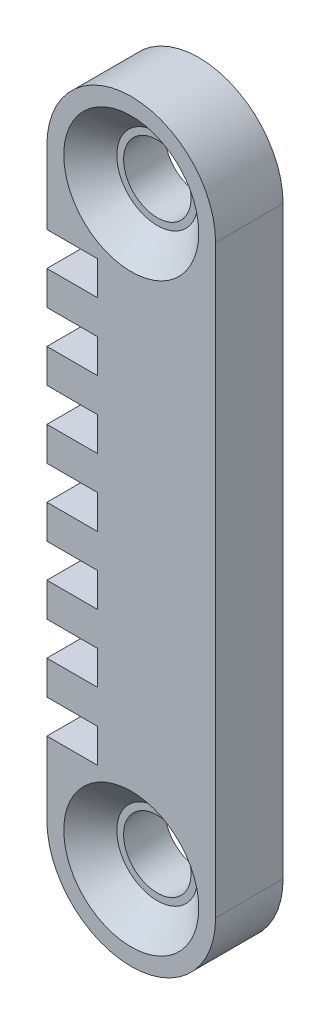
ISO-10303-21;
HEADER;
FILE_DESCRIPTION(('STEP AP214'),'2;1');
FILE_NAME('part.step','',(''),(''),'','','');
FILE_SCHEMA(('AUTOMOTIVE_DESIGN { 1 0 10303 214 1 1 1 1 }'));
ENDSEC;
DATA;
#1=APPLICATION_CONTEXT('core data for automotive mechanical design processes');
#2=APPLICATION_PROTOCOL_DEFINITION('international standard','automotive_design',2000,#1);
#3=PRODUCT_CONTEXT('',#1,'mechanical');
#4=PRODUCT('Part','Part','',(#3));
#5=PRODUCT_RELATED_PRODUCT_CATEGORY('part','',(#4));
#6=PRODUCT_DEFINITION_FORMATION('','',#4);
#7=PRODUCT_DEFINITION_CONTEXT('part definition',#1,'design');
#8=PRODUCT_DEFINITION('design','',#6,#7);
#9=PRODUCT_DEFINITION_SHAPE('','',#8);
#10=(LENGTH_UNIT() NAMED_UNIT(*) SI_UNIT(.MILLI.,.METRE.));
#11=(NAMED_UNIT(*) PLANE_ANGLE_UNIT() SI_UNIT($,.RADIAN.));
#12=(NAMED_UNIT(*) SI_UNIT($,.STERADIAN.) SOLID_ANGLE_UNIT());
#13=UNCERTAINTY_MEASURE_WITH_UNIT(LENGTH_MEASURE(1.E-05),#10,'distance_accuracy_value','');
#14=(GEOMETRIC_REPRESENTATION_CONTEXT(3) GLOBAL_UNCERTAINTY_ASSIGNED_CONTEXT((#13)) GLOBAL_UNIT_ASSIGNED_CONTEXT((#10,
#11,#12)) REPRESENTATION_CONTEXT('',''));
#15=CARTESIAN_POINT('',(0.,0.,0.));
#16=DIRECTION('',(0.,0.,1.));
#17=DIRECTION('',(1.,0.,0.));
#18=AXIS2_PLACEMENT_3D('',#15,#16,#17);
#19=CARTESIAN_POINT('',(-0.999999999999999,0.,2.));
#20=DIRECTION('',(1.,0.,0.));
#21=DIRECTION('',(0.,0.,-1.));
#22=AXIS2_PLACEMENT_3D('',#19,#20,#21);
#23=PLANE('',#22);
#24=DIRECTION('',(0.,-1.,0.));
#25=VECTOR('',#24,1.);
#26=CARTESIAN_POINT('',(-0.999999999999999,0.,0.));
#27=LINE('',#26,#25);
#28=CARTESIAN_POINT('',(-0.999999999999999,0.5,0.));
#29=VERTEX_POINT('',#28);
#30=CARTESIAN_POINT('',(-0.999999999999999,-0.5,0.));
#31=VERTEX_POINT('',#30);
#32=EDGE_CURVE('E297',#29,#31,#27,.T.);
#33=ORIENTED_EDGE('',*,*,#32,.T.);
#34=DIRECTION('',(0.,0.,-1.));
#35=VECTOR('',#34,1.);
#36=CARTESIAN_POINT('',(-0.999999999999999,-0.5,2.));
#37=LINE('',#36,#35);
#38=CARTESIAN_POINT('',(-0.999999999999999,-0.5,2.));
#39=VERTEX_POINT('',#38);
#40=EDGE_CURVE('E11',#39,#31,#37,.T.);
#41=ORIENTED_EDGE('',*,*,#40,.F.);
#42=DIRECTION('',(0.,-1.,0.));
#43=VECTOR('',#42,1.);
#44=CARTESIAN_POINT('',(-0.999999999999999,0.,2.));
#45=LINE('',#44,#43);
#46=CARTESIAN_POINT('',(-0.999999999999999,0.5,2.));
#47=VERTEX_POINT('',#46);
#48=EDGE_CURVE('E400',#47,#39,#45,.T.);
#49=ORIENTED_EDGE('',*,*,#48,.F.);
#50=DIRECTION('',(0.,0.,-1.));
#51=VECTOR('',#50,1.);
#52=CARTESIAN_POINT('',(-0.999999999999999,0.5,2.));
#53=LINE('',#52,#51);
#54=EDGE_CURVE('E289',#47,#29,#53,.T.);
#55=ORIENTED_EDGE('',*,*,#54,.T.);
#56=EDGE_LOOP('',(#33,#41,#49,#55));
#57=FACE_BOUND('',#56,.T.);
#58=ADVANCED_FACE('F45',(#57),#23,.F.);
#59=CARTESIAN_POINT('',(0.,-0.500000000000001,2.));
#60=DIRECTION('',(0.,-1.,0.));
#61=DIRECTION('',(1.,0.,0.));
#62=AXIS2_PLACEMENT_3D('',#59,#60,#61);
#63=PLANE('',#62);
#64=DIRECTION('',(-1.,0.,0.));
#65=VECTOR('',#64,1.);
#66=CARTESIAN_POINT('',(0.,-0.500000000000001,0.));
#67=LINE('',#66,#65);
#68=CARTESIAN_POINT('',(-2.5,-0.499999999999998,0.));
#69=VERTEX_POINT('',#68);
#70=EDGE_CURVE('E302',#31,#69,#67,.T.);
#71=ORIENTED_EDGE('',*,*,#70,.T.);
#72=DIRECTION('',(0.,0.,-1.));
#73=VECTOR('',#72,1.);
#74=CARTESIAN_POINT('',(-2.5,-0.499999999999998,2.));
#75=LINE('',#74,#73);
#76=CARTESIAN_POINT('',(-2.5,-0.499999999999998,2.));
#77=VERTEX_POINT('',#76);
#78=EDGE_CURVE('E56',#77,#69,#75,.T.);
#79=ORIENTED_EDGE('',*,*,#78,.F.);
#80=DIRECTION('',(-1.,0.,0.));
#81=VECTOR('',#80,1.);
#82=CARTESIAN_POINT('',(0.,-0.500000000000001,2.));
#83=LINE('',#82,#81);
#84=EDGE_CURVE('E180',#39,#77,#83,.T.);
#85=ORIENTED_EDGE('',*,*,#84,.F.);
#86=ORIENTED_EDGE('',*,*,#40,.T.);
#87=EDGE_LOOP('',(#71,#79,#85,#86));
#88=FACE_BOUND('',#87,.T.);
#89=ADVANCED_FACE('F641',(#88),#63,.F.);
#90=CARTESIAN_POINT('',(-2.5,0.,2.));
#91=DIRECTION('',(1.,0.,0.));
#92=DIRECTION('',(0.,0.,-1.));
#93=AXIS2_PLACEMENT_3D('',#90,#91,#92);
#94=PLANE('',#93);
#95=DIRECTION('',(0.,-1.,0.));
#96=VECTOR('',#95,1.);
#97=CARTESIAN_POINT('',(-2.5,0.,0.));
#98=LINE('',#97,#96);
#99=CARTESIAN_POINT('',(-2.5,-1.5,0.));
#100=VERTEX_POINT('',#99);
#101=EDGE_CURVE('E305',#69,#100,#98,.T.);
#102=ORIENTED_EDGE('',*,*,#101,.T.);
#103=DIRECTION('',(0.,0.,-1.));
#104=VECTOR('',#103,1.);
#105=CARTESIAN_POINT('',(-2.5,-1.5,2.));
#106=LINE('',#105,#104);
#107=CARTESIAN_POINT('',(-2.5,-1.5,2.));
#108=VERTEX_POINT('',#107);
#109=EDGE_CURVE('E503',#108,#100,#106,.T.);
#110=ORIENTED_EDGE('',*,*,#109,.F.);
#111=DIRECTION('',(0.,-1.,0.));
#112=VECTOR('',#111,1.);
#113=CARTESIAN_POINT('',(-2.5,0.,2.));
#114=LINE('',#113,#112);
#115=EDGE_CURVE('E529',#77,#108,#114,.T.);
#116=ORIENTED_EDGE('',*,*,#115,.F.);
#117=ORIENTED_EDGE('',*,*,#78,.T.);
#118=EDGE_LOOP('',(#102,#110,#116,#117));
#119=FACE_BOUND('',#118,.T.);
#120=ADVANCED_FACE('F645',(#119),#94,.F.);
#121=CARTESIAN_POINT('',(0.,-1.5,2.));
#122=DIRECTION('',(0.,1.,0.));
#123=DIRECTION('',(-1.,0.,0.));
#124=AXIS2_PLACEMENT_3D('',#121,#122,#123);
#125=PLANE('',#124);
#126=DIRECTION('',(1.,0.,0.));
#127=VECTOR('',#126,1.);
#128=CARTESIAN_POINT('',(0.,-1.5,0.));
#129=LINE('',#128,#127);
#130=CARTESIAN_POINT('',(-0.999999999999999,-1.5,0.));
#131=VERTEX_POINT('',#130);
#132=EDGE_CURVE('E308',#100,#131,#129,.T.);
#133=ORIENTED_EDGE('',*,*,#132,.T.);
#134=DIRECTION('',(0.,0.,-1.));
#135=VECTOR('',#134,1.);
#136=CARTESIAN_POINT('',(-0.999999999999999,-1.5,2.));
#137=LINE('',#136,#135);
#138=CARTESIAN_POINT('',(-0.999999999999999,-1.5,2.));
#139=VERTEX_POINT('',#138);
#140=EDGE_CURVE('E499',#139,#131,#137,.T.);
#141=ORIENTED_EDGE('',*,*,#140,.F.);
#142=DIRECTION('',(1.,0.,0.));
#143=VECTOR('',#142,1.);
#144=CARTESIAN_POINT('',(0.,-1.5,2.));
#145=LINE('',#144,#143);
#146=EDGE_CURVE('E532',#108,#139,#145,.T.);
#147=ORIENTED_EDGE('',*,*,#146,.F.);
#148=ORIENTED_EDGE('',*,*,#109,.T.);
#149=EDGE_LOOP('',(#133,#141,#147,#148));
#150=FACE_BOUND('',#149,.T.);
#151=ADVANCED_FACE('F650',(#150),#125,.F.);
#152=CARTESIAN_POINT('',(-0.999999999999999,0.,2.));
#153=DIRECTION('',(1.,0.,0.));
#154=DIRECTION('',(0.,0.,-1.));
#155=AXIS2_PLACEMENT_3D('',#152,#153,#154);
#156=PLANE('',#155);
#157=DIRECTION('',(0.,-1.,0.));
#158=VECTOR('',#157,1.);
#159=CARTESIAN_POINT('',(-0.999999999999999,0.,0.));
#160=LINE('',#159,#158);
#161=CARTESIAN_POINT('',(-0.999999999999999,-2.5,0.));
#162=VERTEX_POINT('',#161);
#163=EDGE_CURVE('E311',#131,#162,#160,.T.);
#164=ORIENTED_EDGE('',*,*,#163,.T.);
#165=DIRECTION('',(0.,0.,-1.));
#166=VECTOR('',#165,1.);
#167=CARTESIAN_POINT('',(-0.999999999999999,-2.5,2.));
#168=LINE('',#167,#166);
#169=CARTESIAN_POINT('',(-0.999999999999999,-2.5,2.));
#170=VERTEX_POINT('',#169);
#171=EDGE_CURVE('E495',#170,#162,#168,.T.);
#172=ORIENTED_EDGE('',*,*,#171,.F.);
#173=DIRECTION('',(0.,-1.,0.));
#174=VECTOR('',#173,1.);
#175=CARTESIAN_POINT('',(-0.999999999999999,0.,2.));
#176=LINE('',#175,#174);
#177=EDGE_CURVE('E535',#139,#170,#176,.T.);
#178=ORIENTED_EDGE('',*,*,#177,.F.);
#179=ORIENTED_EDGE('',*,*,#140,.T.);
#180=EDGE_LOOP('',(#164,#172,#178,#179));
#181=FACE_BOUND('',#180,.T.);
#182=ADVANCED_FACE('F654',(#181),#156,.F.);
#183=CARTESIAN_POINT('',(0.,-2.5,2.));
#184=DIRECTION('',(0.,-1.,0.));
#185=DIRECTION('',(1.,0.,0.));
#186=AXIS2_PLACEMENT_3D('',#183,#184,#185);
#187=PLANE('',#186);
#188=DIRECTION('',(-1.,0.,0.));
#189=VECTOR('',#188,1.);
#190=CARTESIAN_POINT('',(0.,-2.5,0.));
#191=LINE('',#190,#189);
#192=CARTESIAN_POINT('',(-2.5,-2.5,0.));
#193=VERTEX_POINT('',#192);
#194=EDGE_CURVE('E314',#162,#193,#191,.T.);
#195=ORIENTED_EDGE('',*,*,#194,.T.);
#196=DIRECTION('',(0.,0.,-1.));
#197=VECTOR('',#196,1.);
#198=CARTESIAN_POINT('',(-2.5,-2.5,2.));
#199=LINE('',#198,#197);
#200=CARTESIAN_POINT('',(-2.5,-2.5,2.));
#201=VERTEX_POINT('',#200);
#202=EDGE_CURVE('E491',#201,#193,#199,.T.);
#203=ORIENTED_EDGE('',*,*,#202,.F.);
#204=DIRECTION('',(-1.,0.,0.));
#205=VECTOR('',#204,1.);
#206=CARTESIAN_POINT('',(0.,-2.5,2.));
#207=LINE('',#206,#205);
#208=EDGE_CURVE('E538',#170,#201,#207,.T.);
#209=ORIENTED_EDGE('',*,*,#208,.F.);
#210=ORIENTED_EDGE('',*,*,#171,.T.);
#211=EDGE_LOOP('',(#195,#203,#209,#210));
#212=FACE_BOUND('',#211,.T.);
#213=ADVANCED_FACE('F658',(#212),#187,.F.);
#214=CARTESIAN_POINT('',(-2.5,0.,2.));
#215=DIRECTION('',(1.,0.,0.));
#216=DIRECTION('',(0.,0.,-1.));
#217=AXIS2_PLACEMENT_3D('',#214,#215,#216);
#218=PLANE('',#217);
#219=DIRECTION('',(0.,-1.,0.));
#220=VECTOR('',#219,1.);
#221=CARTESIAN_POINT('',(-2.5,0.,0.));
#222=LINE('',#221,#220);
#223=CARTESIAN_POINT('',(-2.5,-3.5,0.));
#224=VERTEX_POINT('',#223);
#225=EDGE_CURVE('E317',#193,#224,#222,.T.);
#226=ORIENTED_EDGE('',*,*,#225,.T.);
#227=DIRECTION('',(0.,0.,-1.));
#228=VECTOR('',#227,1.);
#229=CARTESIAN_POINT('',(-2.5,-3.5,2.));
#230=LINE('',#229,#228);
#231=CARTESIAN_POINT('',(-2.5,-3.5,2.));
#232=VERTEX_POINT('',#231);
#233=EDGE_CURVE('E487',#232,#224,#230,.T.);
#234=ORIENTED_EDGE('',*,*,#233,.F.);
#235=DIRECTION('',(0.,-1.,0.));
#236=VECTOR('',#235,1.);
#237=CARTESIAN_POINT('',(-2.5,0.,2.));
#238=LINE('',#237,#236);
#239=EDGE_CURVE('E541',#201,#232,#238,.T.);
#240=ORIENTED_EDGE('',*,*,#239,.F.);
#241=ORIENTED_EDGE('',*,*,#202,.T.);
#242=EDGE_LOOP('',(#226,#234,#240,#241));
#243=FACE_BOUND('',#242,.T.);
#244=ADVANCED_FACE('F662',(#243),#218,.F.);
#245=CARTESIAN_POINT('',(0.,-3.5,2.));
#246=DIRECTION('',(0.,1.,0.));
#247=DIRECTION('',(-1.,0.,0.));
#248=AXIS2_PLACEMENT_3D('',#245,#246,#247);
#249=PLANE('',#248);
#250=DIRECTION('',(1.,0.,0.));
#251=VECTOR('',#250,1.);
#252=CARTESIAN_POINT('',(0.,-3.5,0.));
#253=LINE('',#252,#251);
#254=CARTESIAN_POINT('',(-0.999999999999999,-3.5,0.));
#255=VERTEX_POINT('',#254);
#256=EDGE_CURVE('E320',#224,#255,#253,.T.);
#257=ORIENTED_EDGE('',*,*,#256,.T.);
#258=DIRECTION('',(0.,0.,-1.));
#259=VECTOR('',#258,1.);
#260=CARTESIAN_POINT('',(-0.999999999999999,-3.5,2.));
#261=LINE('',#260,#259);
#262=CARTESIAN_POINT('',(-0.999999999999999,-3.5,2.));
#263=VERTEX_POINT('',#262);
#264=EDGE_CURVE('E483',#263,#255,#261,.T.);
#265=ORIENTED_EDGE('',*,*,#264,.F.);
#266=DIRECTION('',(1.,0.,0.));
#267=VECTOR('',#266,1.);
#268=CARTESIAN_POINT('',(0.,-3.5,2.));
#269=LINE('',#268,#267);
#270=EDGE_CURVE('E544',#232,#263,#269,.T.);
#271=ORIENTED_EDGE('',*,*,#270,.F.);
#272=ORIENTED_EDGE('',*,*,#233,.T.);
#273=EDGE_LOOP('',(#257,#265,#271,#272));
#274=FACE_BOUND('',#273,.T.);
#275=ADVANCED_FACE('F666',(#274),#249,.F.);
#276=CARTESIAN_POINT('',(-0.999999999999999,0.,2.));
#277=DIRECTION('',(1.,0.,0.));
#278=DIRECTION('',(0.,0.,-1.));
#279=AXIS2_PLACEMENT_3D('',#276,#277,#278);
#280=PLANE('',#279);
#281=DIRECTION('',(0.,-1.,0.));
#282=VECTOR('',#281,1.);
#283=CARTESIAN_POINT('',(-0.999999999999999,0.,0.));
#284=LINE('',#283,#282);
#285=CARTESIAN_POINT('',(-0.999999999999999,-4.5,0.));
#286=VERTEX_POINT('',#285);
#287=EDGE_CURVE('E323',#255,#286,#284,.T.);
#288=ORIENTED_EDGE('',*,*,#287,.T.);
#289=DIRECTION('',(0.,0.,-1.));
#290=VECTOR('',#289,1.);
#291=CARTESIAN_POINT('',(-0.999999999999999,-4.5,2.));
#292=LINE('',#291,#290);
#293=CARTESIAN_POINT('',(-0.999999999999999,-4.5,2.));
#294=VERTEX_POINT('',#293);
#295=EDGE_CURVE('E479',#294,#286,#292,.T.);
#296=ORIENTED_EDGE('',*,*,#295,.F.);
#297=DIRECTION('',(0.,-1.,0.));
#298=VECTOR('',#297,1.);
#299=CARTESIAN_POINT('',(-0.999999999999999,0.,2.));
#300=LINE('',#299,#298);
#301=EDGE_CURVE('E547',#263,#294,#300,.T.);
#302=ORIENTED_EDGE('',*,*,#301,.F.);
#303=ORIENTED_EDGE('',*,*,#264,.T.);
#304=EDGE_LOOP('',(#288,#296,#302,#303));
#305=FACE_BOUND('',#304,.T.);
#306=ADVANCED_FACE('F670',(#305),#280,.F.);
#307=CARTESIAN_POINT('',(0.,-4.5,2.));
#308=DIRECTION('',(0.,-1.,0.));
#309=DIRECTION('',(1.,0.,0.));
#310=AXIS2_PLACEMENT_3D('',#307,#308,#309);
#311=PLANE('',#310);
#312=DIRECTION('',(-1.,0.,0.));
#313=VECTOR('',#312,1.);
#314=CARTESIAN_POINT('',(0.,-4.5,0.));
#315=LINE('',#314,#313);
#316=CARTESIAN_POINT('',(-2.5,-4.5,0.));
#317=VERTEX_POINT('',#316);
#318=EDGE_CURVE('E326',#286,#317,#315,.T.);
#319=ORIENTED_EDGE('',*,*,#318,.T.);
#320=DIRECTION('',(0.,0.,-1.));
#321=VECTOR('',#320,1.);
#322=CARTESIAN_POINT('',(-2.5,-4.5,2.));
#323=LINE('',#322,#321);
#324=CARTESIAN_POINT('',(-2.5,-4.5,2.));
#325=VERTEX_POINT('',#324);
#326=EDGE_CURVE('E475',#325,#317,#323,.T.);
#327=ORIENTED_EDGE('',*,*,#326,.F.);
#328=DIRECTION('',(-1.,0.,0.));
#329=VECTOR('',#328,1.);
#330=CARTESIAN_POINT('',(0.,-4.5,2.));
#331=LINE('',#330,#329);
#332=EDGE_CURVE('E550',#294,#325,#331,.T.);
#333=ORIENTED_EDGE('',*,*,#332,.F.);
#334=ORIENTED_EDGE('',*,*,#295,.T.);
#335=EDGE_LOOP('',(#319,#327,#333,#334));
#336=FACE_BOUND('',#335,.T.);
#337=ADVANCED_FACE('F674',(#336),#311,.F.);
#338=CARTESIAN_POINT('',(-2.5,0.,2.));
#339=DIRECTION('',(1.,0.,0.));
#340=DIRECTION('',(0.,0.,-1.));
#341=AXIS2_PLACEMENT_3D('',#338,#339,#340);
#342=PLANE('',#341);
#343=DIRECTION('',(0.,-1.,0.));
#344=VECTOR('',#343,1.);
#345=CARTESIAN_POINT('',(-2.5,0.,0.));
#346=LINE('',#345,#344);
#347=CARTESIAN_POINT('',(-2.5,-5.5,0.));
#348=VERTEX_POINT('',#347);
#349=EDGE_CURVE('E329',#317,#348,#346,.T.);
#350=ORIENTED_EDGE('',*,*,#349,.T.);
#351=DIRECTION('',(0.,0.,-1.));
#352=VECTOR('',#351,1.);
#353=CARTESIAN_POINT('',(-2.5,-5.5,2.));
#354=LINE('',#353,#352);
#355=CARTESIAN_POINT('',(-2.5,-5.5,2.));
#356=VERTEX_POINT('',#355);
#357=EDGE_CURVE('E471',#356,#348,#354,.T.);
#358=ORIENTED_EDGE('',*,*,#357,.F.);
#359=DIRECTION('',(0.,-1.,0.));
#360=VECTOR('',#359,1.);
#361=CARTESIAN_POINT('',(-2.5,0.,2.));
#362=LINE('',#361,#360);
#363=EDGE_CURVE('E553',#325,#356,#362,.T.);
#364=ORIENTED_EDGE('',*,*,#363,.F.);
#365=ORIENTED_EDGE('',*,*,#326,.T.);
#366=EDGE_LOOP('',(#350,#358,#364,#365));
#367=FACE_BOUND('',#366,.T.);
#368=ADVANCED_FACE('F678',(#367),#342,.F.);
#369=CARTESIAN_POINT('',(0.,-5.5,2.));
#370=DIRECTION('',(0.,1.,0.));
#371=DIRECTION('',(-1.,0.,0.));
#372=AXIS2_PLACEMENT_3D('',#369,#370,#371);
#373=PLANE('',#372);
#374=DIRECTION('',(1.,0.,0.));
#375=VECTOR('',#374,1.);
#376=CARTESIAN_POINT('',(0.,-5.5,0.));
#377=LINE('',#376,#375);
#378=CARTESIAN_POINT('',(-0.999999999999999,-5.5,0.));
#379=VERTEX_POINT('',#378);
#380=EDGE_CURVE('E332',#348,#379,#377,.T.);
#381=ORIENTED_EDGE('',*,*,#380,.T.);
#382=DIRECTION('',(0.,0.,-1.));
#383=VECTOR('',#382,1.);
#384=CARTESIAN_POINT('',(-0.999999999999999,-5.5,2.));
#385=LINE('',#384,#383);
#386=CARTESIAN_POINT('',(-0.999999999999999,-5.5,2.));
#387=VERTEX_POINT('',#386);
#388=EDGE_CURVE('E467',#387,#379,#385,.T.);
#389=ORIENTED_EDGE('',*,*,#388,.F.);
#390=DIRECTION('',(1.,0.,0.));
#391=VECTOR('',#390,1.);
#392=CARTESIAN_POINT('',(0.,-5.5,2.));
#393=LINE('',#392,#391);
#394=EDGE_CURVE('E556',#356,#387,#393,.T.);
#395=ORIENTED_EDGE('',*,*,#394,.F.);
#396=ORIENTED_EDGE('',*,*,#357,.T.);
#397=EDGE_LOOP('',(#381,#389,#395,#396));
#398=FACE_BOUND('',#397,.T.);
#399=ADVANCED_FACE('F682',(#398),#373,.F.);
#400=CARTESIAN_POINT('',(-0.999999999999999,0.,2.));
#401=DIRECTION('',(1.,0.,0.));
#402=DIRECTION('',(0.,0.,-1.));
#403=AXIS2_PLACEMENT_3D('',#400,#401,#402);
#404=PLANE('',#403);
#405=DIRECTION('',(0.,-1.,0.));
#406=VECTOR('',#405,1.);
#407=CARTESIAN_POINT('',(-0.999999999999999,0.,0.));
#408=LINE('',#407,#406);
#409=CARTESIAN_POINT('',(-0.999999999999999,-6.5,0.));
#410=VERTEX_POINT('',#409);
#411=EDGE_CURVE('E335',#379,#410,#408,.T.);
#412=ORIENTED_EDGE('',*,*,#411,.T.);
#413=DIRECTION('',(0.,0.,-1.));
#414=VECTOR('',#413,1.);
#415=CARTESIAN_POINT('',(-0.999999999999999,-6.5,2.));
#416=LINE('',#415,#414);
#417=CARTESIAN_POINT('',(-0.999999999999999,-6.5,2.));
#418=VERTEX_POINT('',#417);
#419=EDGE_CURVE('E463',#418,#410,#416,.T.);
#420=ORIENTED_EDGE('',*,*,#419,.F.);
#421=DIRECTION('',(0.,-1.,0.));
#422=VECTOR('',#421,1.);
#423=CARTESIAN_POINT('',(-0.999999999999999,0.,2.));
#424=LINE('',#423,#422);
#425=EDGE_CURVE('E559',#387,#418,#424,.T.);
#426=ORIENTED_EDGE('',*,*,#425,.F.);
#427=ORIENTED_EDGE('',*,*,#388,.T.);
#428=EDGE_LOOP('',(#412,#420,#426,#427));
#429=FACE_BOUND('',#428,.T.);
#430=ADVANCED_FACE('F686',(#429),#404,.F.);
#431=CARTESIAN_POINT('',(0.,-6.5,2.));
#432=DIRECTION('',(0.,-1.,0.));
#433=DIRECTION('',(1.,0.,0.));
#434=AXIS2_PLACEMENT_3D('',#431,#432,#433);
#435=PLANE('',#434);
#436=DIRECTION('',(-1.,0.,0.));
#437=VECTOR('',#436,1.);
#438=CARTESIAN_POINT('',(0.,-6.5,0.));
#439=LINE('',#438,#437);
#440=CARTESIAN_POINT('',(-2.5,-6.5,0.));
#441=VERTEX_POINT('',#440);
#442=EDGE_CURVE('E338',#410,#441,#439,.T.);
#443=ORIENTED_EDGE('',*,*,#442,.T.);
#444=DIRECTION('',(0.,0.,-1.));
#445=VECTOR('',#444,1.);
#446=CARTESIAN_POINT('',(-2.5,-6.5,2.));
#447=LINE('',#446,#445);
#448=CARTESIAN_POINT('',(-2.5,-6.5,2.));
#449=VERTEX_POINT('',#448);
#450=EDGE_CURVE('E459',#449,#441,#447,.T.);
#451=ORIENTED_EDGE('',*,*,#450,.F.);
#452=DIRECTION('',(-1.,0.,0.));
#453=VECTOR('',#452,1.);
#454=CARTESIAN_POINT('',(0.,-6.5,2.));
#455=LINE('',#454,#453);
#456=EDGE_CURVE('E562',#418,#449,#455,.T.);
#457=ORIENTED_EDGE('',*,*,#456,.F.);
#458=ORIENTED_EDGE('',*,*,#419,.T.);
#459=EDGE_LOOP('',(#443,#451,#457,#458));
#460=FACE_BOUND('',#459,.T.);
#461=ADVANCED_FACE('F690',(#460),#435,.F.);
#462=CARTESIAN_POINT('',(-2.49999999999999,0.,2.));
#463=DIRECTION('',(1.,0.,0.));
#464=DIRECTION('',(0.,1.,0.));
#465=AXIS2_PLACEMENT_3D('',#462,#463,#464);
#466=PLANE('',#465);
#467=DIRECTION('',(0.,-1.,0.));
#468=VECTOR('',#467,1.);
#469=CARTESIAN_POINT('',(-2.49999999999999,0.,0.));
#470=LINE('',#469,#468);
#471=CARTESIAN_POINT('',(-2.5,-8.665,0.));
#472=VERTEX_POINT('',#471);
#473=EDGE_CURVE('E341',#441,#472,#470,.T.);
#474=ORIENTED_EDGE('',*,*,#473,.T.);
#475=DIRECTION('',(0.,0.,-1.));
#476=VECTOR('',#475,1.);
#477=CARTESIAN_POINT('',(-2.5,-8.665,2.));
#478=LINE('',#477,#476);
#479=CARTESIAN_POINT('',(-2.5,-8.665,2.));
#480=VERTEX_POINT('',#479);
#481=EDGE_CURVE('E456',#480,#472,#478,.T.);
#482=ORIENTED_EDGE('',*,*,#481,.F.);
#483=DIRECTION('',(0.,-1.,0.));
#484=VECTOR('',#483,1.);
#485=CARTESIAN_POINT('',(-2.49999999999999,0.,2.));
#486=LINE('',#485,#484);
#487=EDGE_CURVE('E565',#449,#480,#486,.T.);
#488=ORIENTED_EDGE('',*,*,#487,.F.);
#489=ORIENTED_EDGE('',*,*,#450,.T.);
#490=EDGE_LOOP('',(#474,#482,#488,#489));
#491=FACE_BOUND('',#490,.T.);
#492=ADVANCED_FACE('F694',(#491),#466,.F.);
#493=CARTESIAN_POINT('',(0.,-8.665,2.));
#494=DIRECTION('',(0.,0.,-1.));
#495=DIRECTION('',(-1.,0.,0.));
#496=AXIS2_PLACEMENT_3D('',#493,#494,#495);
#497=CYLINDRICAL_SURFACE('',#496,2.5);
#498=CARTESIAN_POINT('',(0.,-8.665,0.));
#499=DIRECTION('',(0.,0.,1.));
#500=DIRECTION('',(1.,0.,0.));
#501=AXIS2_PLACEMENT_3D('',#498,#499,#500);
#502=CIRCLE('',#501,2.5);
#503=CARTESIAN_POINT('',(2.5,-8.665,0.));
#504=VERTEX_POINT('',#503);
#505=EDGE_CURVE('E345',#504,#472,#502,.F.);
#506=ORIENTED_EDGE('',*,*,#505,.F.);
#507=DIRECTION('',(0.,0.,-1.));
#508=VECTOR('',#507,1.);
#509=CARTESIAN_POINT('',(2.5,-8.665,2.));
#510=LINE('',#509,#508);
#511=CARTESIAN_POINT('',(2.5,-8.665,2.));
#512=VERTEX_POINT('',#511);
#513=EDGE_CURVE('E453',#512,#504,#510,.T.);
#514=ORIENTED_EDGE('',*,*,#513,.F.);
#515=CARTESIAN_POINT('',(0.,-8.665,2.));
#516=DIRECTION('',(0.,0.,1.));
#517=DIRECTION('',(1.,0.,0.));
#518=AXIS2_PLACEMENT_3D('',#515,#516,#517);
#519=CIRCLE('',#518,2.5);
#520=EDGE_CURVE('E568',#512,#480,#519,.F.);
#521=ORIENTED_EDGE('',*,*,#520,.T.);
#522=ORIENTED_EDGE('',*,*,#481,.T.);
#523=EDGE_LOOP('',(#506,#514,#521,#522));
#524=FACE_BOUND('',#523,.T.);
#525=ADVANCED_FACE('F698',(#524),#497,.T.);
#526=CARTESIAN_POINT('',(2.5,0.,2.));
#527=DIRECTION('',(1.,0.,0.));
#528=DIRECTION('',(0.,0.,-1.));
#529=AXIS2_PLACEMENT_3D('',#526,#527,#528);
#530=PLANE('',#529);
#531=DIRECTION('',(0.,-1.,0.));
#532=VECTOR('',#531,1.);
#533=CARTESIAN_POINT('',(2.5,0.,0.));
#534=LINE('',#533,#532);
#535=CARTESIAN_POINT('',(2.5,8.665,0.));
#536=VERTEX_POINT('',#535);
#537=EDGE_CURVE('E349',#536,#504,#534,.T.);
#538=ORIENTED_EDGE('',*,*,#537,.F.);
#539=DIRECTION('',(0.,0.,-1.));
#540=VECTOR('',#539,1.);
#541=CARTESIAN_POINT('',(2.5,8.665,2.));
#542=LINE('',#541,#540);
#543=CARTESIAN_POINT('',(2.5,8.665,2.));
#544=VERTEX_POINT('',#543);
#545=EDGE_CURVE('E450',#544,#536,#542,.T.);
#546=ORIENTED_EDGE('',*,*,#545,.F.);
#547=DIRECTION('',(0.,-1.,0.));
#548=VECTOR('',#547,1.);
#549=CARTESIAN_POINT('',(2.5,0.,2.));
#550=LINE('',#549,#548);
#551=EDGE_CURVE('E572',#544,#512,#550,.T.);
#552=ORIENTED_EDGE('',*,*,#551,.T.);
#553=ORIENTED_EDGE('',*,*,#513,.T.);
#554=EDGE_LOOP('',(#538,#546,#552,#553));
#555=FACE_BOUND('',#554,.T.);
#556=ADVANCED_FACE('F702',(#555),#530,.T.);
#557=CARTESIAN_POINT('',(0.,8.665,2.));
#558=DIRECTION('',(0.,0.,-1.));
#559=DIRECTION('',(-1.,0.,0.));
#560=AXIS2_PLACEMENT_3D('',#557,#558,#559);
#561=CYLINDRICAL_SURFACE('',#560,2.5);
#562=CARTESIAN_POINT('',(0.,8.665,0.));
#563=DIRECTION('',(0.,0.,1.));
#564=DIRECTION('',(1.,0.,0.));
#565=AXIS2_PLACEMENT_3D('',#562,#563,#564);
#566=CIRCLE('',#565,2.5);
#567=CARTESIAN_POINT('',(-2.5,8.665,0.));
#568=VERTEX_POINT('',#567);
#569=EDGE_CURVE('E353',#568,#536,#566,.F.);
#570=ORIENTED_EDGE('',*,*,#569,.F.);
#571=DIRECTION('',(0.,0.,-1.));
#572=VECTOR('',#571,1.);
#573=CARTESIAN_POINT('',(-2.5,8.665,2.));
#574=LINE('',#573,#572);
#575=CARTESIAN_POINT('',(-2.5,8.665,2.));
#576=VERTEX_POINT('',#575);
#577=EDGE_CURVE('E447',#576,#568,#574,.T.);
#578=ORIENTED_EDGE('',*,*,#577,.F.);
#579=CARTESIAN_POINT('',(0.,8.665,2.));
#580=DIRECTION('',(0.,0.,1.));
#581=DIRECTION('',(1.,0.,0.));
#582=AXIS2_PLACEMENT_3D('',#579,#580,#581);
#583=CIRCLE('',#582,2.5);
#584=EDGE_CURVE('E576',#576,#544,#583,.F.);
#585=ORIENTED_EDGE('',*,*,#584,.T.);
#586=ORIENTED_EDGE('',*,*,#545,.T.);
#587=EDGE_LOOP('',(#570,#578,#585,#586));
#588=FACE_BOUND('',#587,.T.);
#589=ADVANCED_FACE('F706',(#588),#561,.T.);
#590=CARTESIAN_POINT('',(-2.49999999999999,0.,2.));
#591=DIRECTION('',(1.,0.,0.));
#592=DIRECTION('',(0.,1.,0.));
#593=AXIS2_PLACEMENT_3D('',#590,#591,#592);
#594=PLANE('',#593);
#595=DIRECTION('',(0.,-1.,0.));
#596=VECTOR('',#595,1.);
#597=CARTESIAN_POINT('',(-2.49999999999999,0.,0.));
#598=LINE('',#597,#596);
#599=CARTESIAN_POINT('',(-2.5,6.5,0.));
#600=VERTEX_POINT('',#599);
#601=EDGE_CURVE('E357',#568,#600,#598,.T.);
#602=ORIENTED_EDGE('',*,*,#601,.T.);
#603=DIRECTION('',(0.,0.,-1.));
#604=VECTOR('',#603,1.);
#605=CARTESIAN_POINT('',(-2.5,6.5,2.));
#606=LINE('',#605,#604);
#607=CARTESIAN_POINT('',(-2.5,6.5,2.));
#608=VERTEX_POINT('',#607);
#609=EDGE_CURVE('E443',#608,#600,#606,.T.);
#610=ORIENTED_EDGE('',*,*,#609,.F.);
#611=DIRECTION('',(0.,-1.,0.));
#612=VECTOR('',#611,1.);
#613=CARTESIAN_POINT('',(-2.49999999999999,0.,2.));
#614=LINE('',#613,#612);
#615=EDGE_CURVE('E580',#576,#608,#614,.T.);
#616=ORIENTED_EDGE('',*,*,#615,.F.);
#617=ORIENTED_EDGE('',*,*,#577,.T.);
#618=EDGE_LOOP('',(#602,#610,#616,#617));
#619=FACE_BOUND('',#618,.T.);
#620=ADVANCED_FACE('F710',(#619),#594,.F.);
#621=CARTESIAN_POINT('',(0.,6.5,2.));
#622=DIRECTION('',(0.,1.,0.));
#623=DIRECTION('',(-1.,0.,0.));
#624=AXIS2_PLACEMENT_3D('',#621,#622,#623);
#625=PLANE('',#624);
#626=DIRECTION('',(1.,0.,0.));
#627=VECTOR('',#626,1.);
#628=CARTESIAN_POINT('',(0.,6.5,0.));
#629=LINE('',#628,#627);
#630=CARTESIAN_POINT('',(-0.999999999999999,6.5,0.));
#631=VERTEX_POINT('',#630);
#632=EDGE_CURVE('E360',#600,#631,#629,.T.);
#633=ORIENTED_EDGE('',*,*,#632,.T.);
#634=DIRECTION('',(0.,0.,-1.));
#635=VECTOR('',#634,1.);
#636=CARTESIAN_POINT('',(-0.999999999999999,6.5,2.));
#637=LINE('',#636,#635);
#638=CARTESIAN_POINT('',(-0.999999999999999,6.5,2.));
#639=VERTEX_POINT('',#638);
#640=EDGE_CURVE('E439',#639,#631,#637,.T.);
#641=ORIENTED_EDGE('',*,*,#640,.F.);
#642=DIRECTION('',(1.,0.,0.));
#643=VECTOR('',#642,1.);
#644=CARTESIAN_POINT('',(0.,6.5,2.));
#645=LINE('',#644,#643);
#646=EDGE_CURVE('E583',#608,#639,#645,.T.);
#647=ORIENTED_EDGE('',*,*,#646,.F.);
#648=ORIENTED_EDGE('',*,*,#609,.T.);
#649=EDGE_LOOP('',(#633,#641,#647,#648));
#650=FACE_BOUND('',#649,.T.);
#651=ADVANCED_FACE('F714',(#650),#625,.F.);
#652=CARTESIAN_POINT('',(-0.999999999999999,0.,2.));
#653=DIRECTION('',(1.,0.,0.));
#654=DIRECTION('',(0.,0.,-1.));
#655=AXIS2_PLACEMENT_3D('',#652,#653,#654);
#656=PLANE('',#655);
#657=DIRECTION('',(0.,-1.,0.));
#658=VECTOR('',#657,1.);
#659=CARTESIAN_POINT('',(-0.999999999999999,0.,0.));
#660=LINE('',#659,#658);
#661=CARTESIAN_POINT('',(-0.999999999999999,5.5,0.));
#662=VERTEX_POINT('',#661);
#663=EDGE_CURVE('E363',#631,#662,#660,.T.);
#664=ORIENTED_EDGE('',*,*,#663,.T.);
#665=DIRECTION('',(0.,0.,-1.));
#666=VECTOR('',#665,1.);
#667=CARTESIAN_POINT('',(-0.999999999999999,5.5,2.));
#668=LINE('',#667,#666);
#669=CARTESIAN_POINT('',(-0.999999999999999,5.5,2.));
#670=VERTEX_POINT('',#669);
#671=EDGE_CURVE('E435',#670,#662,#668,.T.);
#672=ORIENTED_EDGE('',*,*,#671,.F.);
#673=DIRECTION('',(0.,-1.,0.));
#674=VECTOR('',#673,1.);
#675=CARTESIAN_POINT('',(-0.999999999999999,0.,2.));
#676=LINE('',#675,#674);
#677=EDGE_CURVE('E586',#639,#670,#676,.T.);
#678=ORIENTED_EDGE('',*,*,#677,.F.);
#679=ORIENTED_EDGE('',*,*,#640,.T.);
#680=EDGE_LOOP('',(#664,#672,#678,#679));
#681=FACE_BOUND('',#680,.T.);
#682=ADVANCED_FACE('F718',(#681),#656,.F.);
#683=CARTESIAN_POINT('',(0.,5.5,2.));
#684=DIRECTION('',(0.,-1.,0.));
#685=DIRECTION('',(1.,0.,0.));
#686=AXIS2_PLACEMENT_3D('',#683,#684,#685);
#687=PLANE('',#686);
#688=DIRECTION('',(-1.,0.,0.));
#689=VECTOR('',#688,1.);
#690=CARTESIAN_POINT('',(0.,5.5,0.));
#691=LINE('',#690,#689);
#692=CARTESIAN_POINT('',(-2.5,5.5,0.));
#693=VERTEX_POINT('',#692);
#694=EDGE_CURVE('E366',#662,#693,#691,.T.);
#695=ORIENTED_EDGE('',*,*,#694,.T.);
#696=DIRECTION('',(0.,0.,-1.));
#697=VECTOR('',#696,1.);
#698=CARTESIAN_POINT('',(-2.5,5.5,2.));
#699=LINE('',#698,#697);
#700=CARTESIAN_POINT('',(-2.5,5.5,2.));
#701=VERTEX_POINT('',#700);
#702=EDGE_CURVE('E431',#701,#693,#699,.T.);
#703=ORIENTED_EDGE('',*,*,#702,.F.);
#704=DIRECTION('',(-1.,0.,0.));
#705=VECTOR('',#704,1.);
#706=CARTESIAN_POINT('',(0.,5.5,2.));
#707=LINE('',#706,#705);
#708=EDGE_CURVE('E589',#670,#701,#707,.T.);
#709=ORIENTED_EDGE('',*,*,#708,.F.);
#710=ORIENTED_EDGE('',*,*,#671,.T.);
#711=EDGE_LOOP('',(#695,#703,#709,#710));
#712=FACE_BOUND('',#711,.T.);
#713=ADVANCED_FACE('F722',(#712),#687,.F.);
#714=CARTESIAN_POINT('',(-2.5,0.,2.));
#715=DIRECTION('',(1.,0.,0.));
#716=DIRECTION('',(0.,0.,-1.));
#717=AXIS2_PLACEMENT_3D('',#714,#715,#716);
#718=PLANE('',#717);
#719=DIRECTION('',(0.,-1.,0.));
#720=VECTOR('',#719,1.);
#721=CARTESIAN_POINT('',(-2.5,0.,0.));
#722=LINE('',#721,#720);
#723=CARTESIAN_POINT('',(-2.5,4.5,0.));
#724=VERTEX_POINT('',#723);
#725=EDGE_CURVE('E369',#693,#724,#722,.T.);
#726=ORIENTED_EDGE('',*,*,#725,.T.);
#727=DIRECTION('',(0.,0.,-1.));
#728=VECTOR('',#727,1.);
#729=CARTESIAN_POINT('',(-2.5,4.5,2.));
#730=LINE('',#729,#728);
#731=CARTESIAN_POINT('',(-2.5,4.5,2.));
#732=VERTEX_POINT('',#731);
#733=EDGE_CURVE('E427',#732,#724,#730,.T.);
#734=ORIENTED_EDGE('',*,*,#733,.F.);
#735=DIRECTION('',(0.,-1.,0.));
#736=VECTOR('',#735,1.);
#737=CARTESIAN_POINT('',(-2.5,0.,2.));
#738=LINE('',#737,#736);
#739=EDGE_CURVE('E592',#701,#732,#738,.T.);
#740=ORIENTED_EDGE('',*,*,#739,.F.);
#741=ORIENTED_EDGE('',*,*,#702,.T.);
#742=EDGE_LOOP('',(#726,#734,#740,#741));
#743=FACE_BOUND('',#742,.T.);
#744=ADVANCED_FACE('F726',(#743),#718,.F.);
#745=CARTESIAN_POINT('',(0.,4.5,2.));
#746=DIRECTION('',(0.,1.,0.));
#747=DIRECTION('',(-1.,0.,0.));
#748=AXIS2_PLACEMENT_3D('',#745,#746,#747);
#749=PLANE('',#748);
#750=DIRECTION('',(1.,0.,0.));
#751=VECTOR('',#750,1.);
#752=CARTESIAN_POINT('',(0.,4.5,0.));
#753=LINE('',#752,#751);
#754=CARTESIAN_POINT('',(-0.999999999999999,4.5,0.));
#755=VERTEX_POINT('',#754);
#756=EDGE_CURVE('E372',#724,#755,#753,.T.);
#757=ORIENTED_EDGE('',*,*,#756,.T.);
#758=DIRECTION('',(0.,0.,-1.));
#759=VECTOR('',#758,1.);
#760=CARTESIAN_POINT('',(-0.999999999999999,4.5,2.));
#761=LINE('',#760,#759);
#762=CARTESIAN_POINT('',(-0.999999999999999,4.5,2.));
#763=VERTEX_POINT('',#762);
#764=EDGE_CURVE('E423',#763,#755,#761,.T.);
#765=ORIENTED_EDGE('',*,*,#764,.F.);
#766=DIRECTION('',(1.,0.,0.));
#767=VECTOR('',#766,1.);
#768=CARTESIAN_POINT('',(0.,4.5,2.));
#769=LINE('',#768,#767);
#770=EDGE_CURVE('E595',#732,#763,#769,.T.);
#771=ORIENTED_EDGE('',*,*,#770,.F.);
#772=ORIENTED_EDGE('',*,*,#733,.T.);
#773=EDGE_LOOP('',(#757,#765,#771,#772));
#774=FACE_BOUND('',#773,.T.);
#775=ADVANCED_FACE('F730',(#774),#749,.F.);
#776=CARTESIAN_POINT('',(-0.999999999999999,0.,2.));
#777=DIRECTION('',(1.,0.,0.));
#778=DIRECTION('',(0.,0.,-1.));
#779=AXIS2_PLACEMENT_3D('',#776,#777,#778);
#780=PLANE('',#779);
#781=DIRECTION('',(0.,-1.,0.));
#782=VECTOR('',#781,1.);
#783=CARTESIAN_POINT('',(-0.999999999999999,0.,0.));
#784=LINE('',#783,#782);
#785=CARTESIAN_POINT('',(-0.999999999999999,3.5,0.));
#786=VERTEX_POINT('',#785);
#787=EDGE_CURVE('E375',#755,#786,#784,.T.);
#788=ORIENTED_EDGE('',*,*,#787,.T.);
#789=DIRECTION('',(0.,0.,-1.));
#790=VECTOR('',#789,1.);
#791=CARTESIAN_POINT('',(-0.999999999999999,3.5,2.));
#792=LINE('',#791,#790);
#793=CARTESIAN_POINT('',(-0.999999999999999,3.5,2.));
#794=VERTEX_POINT('',#793);
#795=EDGE_CURVE('E419',#794,#786,#792,.T.);
#796=ORIENTED_EDGE('',*,*,#795,.F.);
#797=DIRECTION('',(0.,-1.,0.));
#798=VECTOR('',#797,1.);
#799=CARTESIAN_POINT('',(-0.999999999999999,0.,2.));
#800=LINE('',#799,#798);
#801=EDGE_CURVE('E598',#763,#794,#800,.T.);
#802=ORIENTED_EDGE('',*,*,#801,.F.);
#803=ORIENTED_EDGE('',*,*,#764,.T.);
#804=EDGE_LOOP('',(#788,#796,#802,#803));
#805=FACE_BOUND('',#804,.T.);
#806=ADVANCED_FACE('F734',(#805),#780,.F.);
#807=CARTESIAN_POINT('',(0.,3.5,2.));
#808=DIRECTION('',(0.,-1.,0.));
#809=DIRECTION('',(1.,0.,0.));
#810=AXIS2_PLACEMENT_3D('',#807,#808,#809);
#811=PLANE('',#810);
#812=DIRECTION('',(-1.,0.,0.));
#813=VECTOR('',#812,1.);
#814=CARTESIAN_POINT('',(0.,3.5,0.));
#815=LINE('',#814,#813);
#816=CARTESIAN_POINT('',(-2.5,3.5,0.));
#817=VERTEX_POINT('',#816);
#818=EDGE_CURVE('E378',#786,#817,#815,.T.);
#819=ORIENTED_EDGE('',*,*,#818,.T.);
#820=DIRECTION('',(0.,0.,-1.));
#821=VECTOR('',#820,1.);
#822=CARTESIAN_POINT('',(-2.5,3.5,2.));
#823=LINE('',#822,#821);
#824=CARTESIAN_POINT('',(-2.5,3.5,2.));
#825=VERTEX_POINT('',#824);
#826=EDGE_CURVE('E415',#825,#817,#823,.T.);
#827=ORIENTED_EDGE('',*,*,#826,.F.);
#828=DIRECTION('',(-1.,0.,0.));
#829=VECTOR('',#828,1.);
#830=CARTESIAN_POINT('',(0.,3.5,2.));
#831=LINE('',#830,#829);
#832=EDGE_CURVE('E601',#794,#825,#831,.T.);
#833=ORIENTED_EDGE('',*,*,#832,.F.);
#834=ORIENTED_EDGE('',*,*,#795,.T.);
#835=EDGE_LOOP('',(#819,#827,#833,#834));
#836=FACE_BOUND('',#835,.T.);
#837=ADVANCED_FACE('F738',(#836),#811,.F.);
#838=CARTESIAN_POINT('',(-2.5,0.,2.));
#839=DIRECTION('',(1.,0.,0.));
#840=DIRECTION('',(0.,0.,-1.));
#841=AXIS2_PLACEMENT_3D('',#838,#839,#840);
#842=PLANE('',#841);
#843=DIRECTION('',(0.,-1.,0.));
#844=VECTOR('',#843,1.);
#845=CARTESIAN_POINT('',(-2.5,0.,0.));
#846=LINE('',#845,#844);
#847=CARTESIAN_POINT('',(-2.5,2.5,0.));
#848=VERTEX_POINT('',#847);
#849=EDGE_CURVE('E381',#817,#848,#846,.T.);
#850=ORIENTED_EDGE('',*,*,#849,.T.);
#851=DIRECTION('',(0.,0.,-1.));
#852=VECTOR('',#851,1.);
#853=CARTESIAN_POINT('',(-2.5,2.5,2.));
#854=LINE('',#853,#852);
#855=CARTESIAN_POINT('',(-2.5,2.5,2.));
#856=VERTEX_POINT('',#855);
#857=EDGE_CURVE('E411',#856,#848,#854,.T.);
#858=ORIENTED_EDGE('',*,*,#857,.F.);
#859=DIRECTION('',(0.,-1.,0.));
#860=VECTOR('',#859,1.);
#861=CARTESIAN_POINT('',(-2.5,0.,2.));
#862=LINE('',#861,#860);
#863=EDGE_CURVE('E604',#825,#856,#862,.T.);
#864=ORIENTED_EDGE('',*,*,#863,.F.);
#865=ORIENTED_EDGE('',*,*,#826,.T.);
#866=EDGE_LOOP('',(#850,#858,#864,#865));
#867=FACE_BOUND('',#866,.T.);
#868=ADVANCED_FACE('F742',(#867),#842,.F.);
#869=CARTESIAN_POINT('',(0.,2.5,2.));
#870=DIRECTION('',(0.,1.,0.));
#871=DIRECTION('',(-1.,0.,0.));
#872=AXIS2_PLACEMENT_3D('',#869,#870,#871);
#873=PLANE('',#872);
#874=DIRECTION('',(1.,0.,0.));
#875=VECTOR('',#874,1.);
#876=CARTESIAN_POINT('',(0.,2.5,0.));
#877=LINE('',#876,#875);
#878=CARTESIAN_POINT('',(-0.999999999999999,2.5,0.));
#879=VERTEX_POINT('',#878);
#880=EDGE_CURVE('E384',#848,#879,#877,.T.);
#881=ORIENTED_EDGE('',*,*,#880,.T.);
#882=DIRECTION('',(0.,0.,-1.));
#883=VECTOR('',#882,1.);
#884=CARTESIAN_POINT('',(-0.999999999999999,2.5,2.));
#885=LINE('',#884,#883);
#886=CARTESIAN_POINT('',(-0.999999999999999,2.5,2.));
#887=VERTEX_POINT('',#886);
#888=EDGE_CURVE('E407',#887,#879,#885,.T.);
#889=ORIENTED_EDGE('',*,*,#888,.F.);
#890=DIRECTION('',(1.,0.,0.));
#891=VECTOR('',#890,1.);
#892=CARTESIAN_POINT('',(0.,2.5,2.));
#893=LINE('',#892,#891);
#894=EDGE_CURVE('E607',#856,#887,#893,.T.);
#895=ORIENTED_EDGE('',*,*,#894,.F.);
#896=ORIENTED_EDGE('',*,*,#857,.T.);
#897=EDGE_LOOP('',(#881,#889,#895,#896));
#898=FACE_BOUND('',#897,.T.);
#899=ADVANCED_FACE('F615',(#898),#873,.F.);
#900=CARTESIAN_POINT('',(-0.999999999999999,0.,2.));
#901=DIRECTION('',(1.,0.,0.));
#902=DIRECTION('',(0.,0.,-1.));
#903=AXIS2_PLACEMENT_3D('',#900,#901,#902);
#904=PLANE('',#903);
#905=DIRECTION('',(0.,-1.,0.));
#906=VECTOR('',#905,1.);
#907=CARTESIAN_POINT('',(-0.999999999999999,0.,0.));
#908=LINE('',#907,#906);
#909=CARTESIAN_POINT('',(-0.999999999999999,1.5,0.));
#910=VERTEX_POINT('',#909);
#911=EDGE_CURVE('E387',#879,#910,#908,.T.);
#912=ORIENTED_EDGE('',*,*,#911,.T.);
#913=DIRECTION('',(0.,0.,-1.));
#914=VECTOR('',#913,1.);
#915=CARTESIAN_POINT('',(-0.999999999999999,1.5,2.));
#916=LINE('',#915,#914);
#917=CARTESIAN_POINT('',(-0.999999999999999,1.5,2.));
#918=VERTEX_POINT('',#917);
#919=EDGE_CURVE('E282',#918,#910,#916,.T.);
#920=ORIENTED_EDGE('',*,*,#919,.F.);
#921=DIRECTION('',(0.,-1.,0.));
#922=VECTOR('',#921,1.);
#923=CARTESIAN_POINT('',(-0.999999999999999,0.,2.));
#924=LINE('',#923,#922);
#925=EDGE_CURVE('E271',#887,#918,#924,.T.);
#926=ORIENTED_EDGE('',*,*,#925,.F.);
#927=ORIENTED_EDGE('',*,*,#888,.T.);
#928=EDGE_LOOP('',(#912,#920,#926,#927));
#929=FACE_BOUND('',#928,.T.);
#930=ADVANCED_FACE('F619',(#929),#904,.F.);
#931=CARTESIAN_POINT('',(0.,1.5,2.));
#932=DIRECTION('',(0.,-1.,0.));
#933=DIRECTION('',(1.,0.,0.));
#934=AXIS2_PLACEMENT_3D('',#931,#932,#933);
#935=PLANE('',#934);
#936=DIRECTION('',(-1.,0.,0.));
#937=VECTOR('',#936,1.);
#938=CARTESIAN_POINT('',(0.,1.5,0.));
#939=LINE('',#938,#937);
#940=CARTESIAN_POINT('',(-2.5,1.5,0.));
#941=VERTEX_POINT('',#940);
#942=EDGE_CURVE('E280',#910,#941,#939,.T.);
#943=ORIENTED_EDGE('',*,*,#942,.T.);
#944=DIRECTION('',(0.,0.,-1.));
#945=VECTOR('',#944,1.);
#946=CARTESIAN_POINT('',(-2.5,1.5,2.));
#947=LINE('',#946,#945);
#948=CARTESIAN_POINT('',(-2.5,1.5,2.));
#949=VERTEX_POINT('',#948);
#950=EDGE_CURVE('E277',#949,#941,#947,.T.);
#951=ORIENTED_EDGE('',*,*,#950,.F.);
#952=DIRECTION('',(-1.,0.,0.));
#953=VECTOR('',#952,1.);
#954=CARTESIAN_POINT('',(0.,1.5,2.));
#955=LINE('',#954,#953);
#956=EDGE_CURVE('E265',#918,#949,#955,.T.);
#957=ORIENTED_EDGE('',*,*,#956,.F.);
#958=ORIENTED_EDGE('',*,*,#919,.T.);
#959=EDGE_LOOP('',(#943,#951,#957,#958));
#960=FACE_BOUND('',#959,.T.);
#961=ADVANCED_FACE('F278',(#960),#935,.F.);
#962=CARTESIAN_POINT('',(-2.5,0.,2.));
#963=DIRECTION('',(1.,0.,0.));
#964=DIRECTION('',(0.,0.,-1.));
#965=AXIS2_PLACEMENT_3D('',#962,#963,#964);
#966=PLANE('',#965);
#967=DIRECTION('',(0.,-1.,0.));
#968=VECTOR('',#967,1.);
#969=CARTESIAN_POINT('',(-2.5,0.,0.));
#970=LINE('',#969,#968);
#971=CARTESIAN_POINT('',(-2.5,0.500000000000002,0.));
#972=VERTEX_POINT('',#971);
#973=EDGE_CURVE('E166',#941,#972,#970,.T.);
#974=ORIENTED_EDGE('',*,*,#973,.T.);
#975=DIRECTION('',(0.,0.,-1.));
#976=VECTOR('',#975,1.);
#977=CARTESIAN_POINT('',(-2.5,0.500000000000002,2.));
#978=LINE('',#977,#976);
#979=CARTESIAN_POINT('',(-2.5,0.500000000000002,2.));
#980=VERTEX_POINT('',#979);
#981=EDGE_CURVE('E283',#980,#972,#978,.T.);
#982=ORIENTED_EDGE('',*,*,#981,.F.);
#983=DIRECTION('',(0.,-1.,0.));
#984=VECTOR('',#983,1.);
#985=CARTESIAN_POINT('',(-2.5,0.,2.));
#986=LINE('',#985,#984);
#987=EDGE_CURVE('E269',#949,#980,#986,.T.);
#988=ORIENTED_EDGE('',*,*,#987,.F.);
#989=ORIENTED_EDGE('',*,*,#950,.T.);
#990=EDGE_LOOP('',(#974,#982,#988,#989));
#991=FACE_BOUND('',#990,.T.);
#992=ADVANCED_FACE('F285',(#991),#966,.F.);
#993=CARTESIAN_POINT('',(0.,0.499999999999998,2.));
#994=DIRECTION('',(0.,1.,0.));
#995=DIRECTION('',(-1.,0.,0.));
#996=AXIS2_PLACEMENT_3D('',#993,#994,#995);
#997=PLANE('',#996);
#998=DIRECTION('',(1.,0.,0.));
#999=VECTOR('',#998,1.);
#1000=CARTESIAN_POINT('',(0.,0.499999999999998,0.));
#1001=LINE('',#1000,#999);
#1002=EDGE_CURVE('E172',#972,#29,#1001,.T.);
#1003=ORIENTED_EDGE('',*,*,#1002,.T.);
#1004=ORIENTED_EDGE('',*,*,#54,.F.);
#1005=DIRECTION('',(1.,0.,0.));
#1006=VECTOR('',#1005,1.);
#1007=CARTESIAN_POINT('',(0.,0.499999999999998,2.));
#1008=LINE('',#1007,#1006);
#1009=EDGE_CURVE('E65',#980,#47,#1008,.T.);
#1010=ORIENTED_EDGE('',*,*,#1009,.F.);
#1011=ORIENTED_EDGE('',*,*,#981,.T.);
#1012=EDGE_LOOP('',(#1003,#1004,#1010,#1011));
#1013=FACE_BOUND('',#1012,.T.);
#1014=ADVANCED_FACE('F628',(#1013),#997,.F.);
#1015=CARTESIAN_POINT('',(0.,8.665,2.));
#1016=DIRECTION('',(0.,0.,-1.));
#1017=DIRECTION('',(-1.,0.,0.));
#1018=AXIS2_PLACEMENT_3D('',#1015,#1016,#1017);
#1019=CYLINDRICAL_SURFACE('',#1018,0.999999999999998);
#1020=CARTESIAN_POINT('',(0.,8.665,1.22744898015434));
#1021=DIRECTION('',(0.,0.,-1.));
#1022=DIRECTION('',(-1.,0.,0.));
#1023=AXIS2_PLACEMENT_3D('',#1020,#1021,#1022);
#1024=CIRCLE('',#1023,0.999999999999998);
#1025=CARTESIAN_POINT('',(-0.999999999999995,8.665,1.22744898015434));
#1026=VERTEX_POINT('',#1025);
#1027=EDGE_CURVE('E49',#1026,#1026,#1024,.T.);
#1028=ORIENTED_EDGE('',*,*,#1027,.F.);
#1029=EDGE_LOOP('',(#1028));
#1030=FACE_BOUND('',#1029,.T.);
#1031=CARTESIAN_POINT('',(0.,8.665,0.));
#1032=DIRECTION('',(0.,0.,1.));
#1033=DIRECTION('',(1.,0.,0.));
#1034=AXIS2_PLACEMENT_3D('',#1031,#1032,#1033);
#1035=CIRCLE('',#1034,0.999999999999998);
#1036=CARTESIAN_POINT('',(1.,8.665,0.));
#1037=VERTEX_POINT('',#1036);
#1038=EDGE_CURVE('E293',#1037,#1037,#1035,.T.);
#1039=ORIENTED_EDGE('',*,*,#1038,.F.);
#1040=EDGE_LOOP('',(#1039));
#1041=FACE_BOUND('',#1040,.T.);
#1042=ADVANCED_FACE('F47',(#1030,#1041),#1019,.F.);
#1043=CARTESIAN_POINT('',(0.,-8.665,2.));
#1044=DIRECTION('',(0.,0.,-1.));
#1045=DIRECTION('',(-1.,0.,0.));
#1046=AXIS2_PLACEMENT_3D('',#1043,#1044,#1045);
#1047=CYLINDRICAL_SURFACE('',#1046,1.);
#1048=CARTESIAN_POINT('',(0.,-8.665,1.22744898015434));
#1049=DIRECTION('',(0.,0.,-1.));
#1050=DIRECTION('',(-1.,0.,0.));
#1051=AXIS2_PLACEMENT_3D('',#1048,#1049,#1050);
#1052=CIRCLE('',#1051,1.);
#1053=CARTESIAN_POINT('',(-1.,-8.665,1.22744898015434));
#1054=VERTEX_POINT('',#1053);
#1055=EDGE_CURVE('E298',#1054,#1054,#1052,.T.);
#1056=ORIENTED_EDGE('',*,*,#1055,.F.);
#1057=EDGE_LOOP('',(#1056));
#1058=FACE_BOUND('',#1057,.T.);
#1059=CARTESIAN_POINT('',(0.,-8.665,0.));
#1060=DIRECTION('',(0.,0.,1.));
#1061=DIRECTION('',(1.,0.,0.));
#1062=AXIS2_PLACEMENT_3D('',#1059,#1060,#1061);
#1063=CIRCLE('',#1062,1.);
#1064=CARTESIAN_POINT('',(1.,-8.665,0.));
#1065=VERTEX_POINT('',#1064);
#1066=EDGE_CURVE('E396',#1065,#1065,#1063,.T.);
#1067=ORIENTED_EDGE('',*,*,#1066,.F.);
#1068=EDGE_LOOP('',(#1067));
#1069=FACE_BOUND('',#1068,.T.);
#1070=ADVANCED_FACE('F636',(#1058,#1069),#1047,.F.);
#1071=CARTESIAN_POINT('',(0.,0.,2.));
#1072=DIRECTION('',(0.,0.,1.));
#1073=DIRECTION('',(1.,0.,0.));
#1074=AXIS2_PLACEMENT_3D('',#1071,#1072,#1073);
#1075=PLANE('',#1074);
#1076=CARTESIAN_POINT('',(0.,8.665,2.));
#1077=DIRECTION('',(0.,0.,1.));
#1078=DIRECTION('',(1.,0.,0.));
#1079=AXIS2_PLACEMENT_3D('',#1076,#1077,#1078);
#1080=CIRCLE('',#1079,2.);
#1081=CARTESIAN_POINT('',(2.,8.665,2.));
#1082=VERTEX_POINT('',#1081);
#1083=EDGE_CURVE('E862',#1082,#1082,#1080,.T.);
#1084=ORIENTED_EDGE('',*,*,#1083,.F.);
#1085=EDGE_LOOP('',(#1084));
#1086=FACE_BOUND('',#1085,.T.);
#1087=CARTESIAN_POINT('',(0.,-8.665,2.));
#1088=DIRECTION('',(0.,0.,1.));
#1089=DIRECTION('',(1.,0.,0.));
#1090=AXIS2_PLACEMENT_3D('',#1087,#1088,#1089);
#1091=CIRCLE('',#1090,2.);
#1092=CARTESIAN_POINT('',(2.,-8.665,2.));
#1093=VERTEX_POINT('',#1092);
#1094=EDGE_CURVE('E511',#1093,#1093,#1091,.T.);
#1095=ORIENTED_EDGE('',*,*,#1094,.F.);
#1096=EDGE_LOOP('',(#1095));
#1097=FACE_BOUND('',#1096,.T.);
#1098=ORIENTED_EDGE('',*,*,#48,.T.);
#1099=ORIENTED_EDGE('',*,*,#84,.T.);
#1100=ORIENTED_EDGE('',*,*,#115,.T.);
#1101=ORIENTED_EDGE('',*,*,#146,.T.);
#1102=ORIENTED_EDGE('',*,*,#177,.T.);
#1103=ORIENTED_EDGE('',*,*,#208,.T.);
#1104=ORIENTED_EDGE('',*,*,#239,.T.);
#1105=ORIENTED_EDGE('',*,*,#270,.T.);
#1106=ORIENTED_EDGE('',*,*,#301,.T.);
#1107=ORIENTED_EDGE('',*,*,#332,.T.);
#1108=ORIENTED_EDGE('',*,*,#363,.T.);
#1109=ORIENTED_EDGE('',*,*,#394,.T.);
#1110=ORIENTED_EDGE('',*,*,#425,.T.);
#1111=ORIENTED_EDGE('',*,*,#456,.T.);
#1112=ORIENTED_EDGE('',*,*,#487,.T.);
#1113=ORIENTED_EDGE('',*,*,#520,.F.);
#1114=ORIENTED_EDGE('',*,*,#551,.F.);
#1115=ORIENTED_EDGE('',*,*,#584,.F.);
#1116=ORIENTED_EDGE('',*,*,#615,.T.);
#1117=ORIENTED_EDGE('',*,*,#646,.T.);
#1118=ORIENTED_EDGE('',*,*,#677,.T.);
#1119=ORIENTED_EDGE('',*,*,#708,.T.);
#1120=ORIENTED_EDGE('',*,*,#739,.T.);
#1121=ORIENTED_EDGE('',*,*,#770,.T.);
#1122=ORIENTED_EDGE('',*,*,#801,.T.);
#1123=ORIENTED_EDGE('',*,*,#832,.T.);
#1124=ORIENTED_EDGE('',*,*,#863,.T.);
#1125=ORIENTED_EDGE('',*,*,#894,.T.);
#1126=ORIENTED_EDGE('',*,*,#925,.T.);
#1127=ORIENTED_EDGE('',*,*,#956,.T.);
#1128=ORIENTED_EDGE('',*,*,#987,.T.);
#1129=ORIENTED_EDGE('',*,*,#1009,.T.);
#1130=EDGE_LOOP('',(#1098,#1099,#1100,#1101,#1102,#1103,#1104,#1105,#1106,#1107,#1108,#1109,
#1110,#1111,#1112,#1113,#1114,#1115,#1116,#1117,#1118,#1119,#1120,#1121,#1122,#1123,#1124,#1125,
#1126,#1127,#1128,#1129));
#1131=FACE_BOUND('',#1130,.T.);
#1132=ADVANCED_FACE('F267',(#1086,#1097,#1131),#1075,.T.);
#1133=CARTESIAN_POINT('',(0.,0.,0.));
#1134=DIRECTION('',(0.,0.,1.));
#1135=DIRECTION('',(1.,0.,0.));
#1136=AXIS2_PLACEMENT_3D('',#1133,#1134,#1135);
#1137=PLANE('',#1136);
#1138=ORIENTED_EDGE('',*,*,#1038,.T.);
#1139=EDGE_LOOP('',(#1138));
#1140=FACE_BOUND('',#1139,.T.);
#1141=ORIENTED_EDGE('',*,*,#32,.F.);
#1142=ORIENTED_EDGE('',*,*,#1002,.F.);
#1143=ORIENTED_EDGE('',*,*,#973,.F.);
#1144=ORIENTED_EDGE('',*,*,#942,.F.);
#1145=ORIENTED_EDGE('',*,*,#911,.F.);
#1146=ORIENTED_EDGE('',*,*,#880,.F.);
#1147=ORIENTED_EDGE('',*,*,#849,.F.);
#1148=ORIENTED_EDGE('',*,*,#818,.F.);
#1149=ORIENTED_EDGE('',*,*,#787,.F.);
#1150=ORIENTED_EDGE('',*,*,#756,.F.);
#1151=ORIENTED_EDGE('',*,*,#725,.F.);
#1152=ORIENTED_EDGE('',*,*,#694,.F.);
#1153=ORIENTED_EDGE('',*,*,#663,.F.);
#1154=ORIENTED_EDGE('',*,*,#632,.F.);
#1155=ORIENTED_EDGE('',*,*,#601,.F.);
#1156=ORIENTED_EDGE('',*,*,#569,.T.);
#1157=ORIENTED_EDGE('',*,*,#537,.T.);
#1158=ORIENTED_EDGE('',*,*,#505,.T.);
#1159=ORIENTED_EDGE('',*,*,#473,.F.);
#1160=ORIENTED_EDGE('',*,*,#442,.F.);
#1161=ORIENTED_EDGE('',*,*,#411,.F.);
#1162=ORIENTED_EDGE('',*,*,#380,.F.);
#1163=ORIENTED_EDGE('',*,*,#349,.F.);
#1164=ORIENTED_EDGE('',*,*,#318,.F.);
#1165=ORIENTED_EDGE('',*,*,#287,.F.);
#1166=ORIENTED_EDGE('',*,*,#256,.F.);
#1167=ORIENTED_EDGE('',*,*,#225,.F.);
#1168=ORIENTED_EDGE('',*,*,#194,.F.);
#1169=ORIENTED_EDGE('',*,*,#163,.F.);
#1170=ORIENTED_EDGE('',*,*,#132,.F.);
#1171=ORIENTED_EDGE('',*,*,#101,.F.);
#1172=ORIENTED_EDGE('',*,*,#70,.F.);
#1173=EDGE_LOOP('',(#1141,#1142,#1143,#1144,#1145,#1146,#1147,#1148,#1149,#1150,#1151,#1152,
#1153,#1154,#1155,#1156,#1157,#1158,#1159,#1160,#1161,#1162,#1163,#1164,#1165,#1166,#1167,#1168,
#1169,#1170,#1171,#1172));
#1174=FACE_BOUND('',#1173,.T.);
#1175=ORIENTED_EDGE('',*,*,#1066,.T.);
#1176=EDGE_LOOP('',(#1175));
#1177=FACE_BOUND('',#1176,.T.);
#1178=ADVANCED_FACE('F622',(#1140,#1174,#1177),#1137,.F.);
#1179=CARTESIAN_POINT('',(0.,-8.665,2.));
#1180=DIRECTION('',(0.,0.,1.));
#1181=DIRECTION('',(1.,0.,0.));
#1182=AXIS2_PLACEMENT_3D('',#1179,#1180,#1181);
#1183=CONICAL_SURFACE('',#1182,2.,0.802851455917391);
#1184=CARTESIAN_POINT('',(0.,-8.665,1.22744898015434));
#1185=DIRECTION('',(0.,0.,1.));
#1186=DIRECTION('',(1.,0.,0.));
#1187=AXIS2_PLACEMENT_3D('',#1184,#1185,#1186);
#1188=CIRCLE('',#1187,1.2);
#1189=CARTESIAN_POINT('',(1.2,-8.665,1.22744898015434));
#1190=VERTEX_POINT('',#1189);
#1191=EDGE_CURVE('E516',#1190,#1190,#1188,.T.);
#1192=ORIENTED_EDGE('',*,*,#1191,.F.);
#1193=EDGE_LOOP('',(#1192));
#1194=FACE_BOUND('',#1193,.T.);
#1195=ORIENTED_EDGE('',*,*,#1094,.T.);
#1196=EDGE_LOOP('',(#1195));
#1197=FACE_BOUND('',#1196,.T.);
#1198=ADVANCED_FACE('F811',(#1194,#1197),#1183,.F.);
#1199=CARTESIAN_POINT('',(1.2,-8.665,1.22744898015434));
#1200=DIRECTION('',(0.,0.,-1.));
#1201=DIRECTION('',(-1.,0.,0.));
#1202=AXIS2_PLACEMENT_3D('',#1199,#1200,#1201);
#1203=PLANE('',#1202);
#1204=ORIENTED_EDGE('',*,*,#1055,.T.);
#1205=EDGE_LOOP('',(#1204));
#1206=FACE_BOUND('',#1205,.T.);
#1207=ORIENTED_EDGE('',*,*,#1191,.T.);
#1208=EDGE_LOOP('',(#1207));
#1209=FACE_BOUND('',#1208,.T.);
#1210=ADVANCED_FACE('F823',(#1206,#1209),#1203,.F.);
#1211=CARTESIAN_POINT('',(0.,8.665,2.));
#1212=DIRECTION('',(0.,0.,1.));
#1213=DIRECTION('',(1.,0.,0.));
#1214=AXIS2_PLACEMENT_3D('',#1211,#1212,#1213);
#1215=CONICAL_SURFACE('',#1214,2.,0.802851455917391);
#1216=CARTESIAN_POINT('',(0.,8.665,1.22744898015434));
#1217=DIRECTION('',(0.,0.,1.));
#1218=DIRECTION('',(1.,0.,0.));
#1219=AXIS2_PLACEMENT_3D('',#1216,#1217,#1218);
#1220=CIRCLE('',#1219,1.2);
#1221=CARTESIAN_POINT('',(1.2,8.665,1.22744898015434));
#1222=VERTEX_POINT('',#1221);
#1223=EDGE_CURVE('E860',#1222,#1222,#1220,.T.);
#1224=ORIENTED_EDGE('',*,*,#1223,.F.);
#1225=EDGE_LOOP('',(#1224));
#1226=FACE_BOUND('',#1225,.T.);
#1227=ORIENTED_EDGE('',*,*,#1083,.T.);
#1228=EDGE_LOOP('',(#1227));
#1229=FACE_BOUND('',#1228,.T.);
#1230=ADVANCED_FACE('F833',(#1226,#1229),#1215,.F.);
#1231=CARTESIAN_POINT('',(1.2,8.665,1.22744898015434));
#1232=DIRECTION('',(0.,0.,-1.));
#1233=DIRECTION('',(-1.,0.,0.));
#1234=AXIS2_PLACEMENT_3D('',#1231,#1232,#1233);
#1235=PLANE('',#1234);
#1236=ORIENTED_EDGE('',*,*,#1027,.T.);
#1237=EDGE_LOOP('',(#1236));
#1238=FACE_BOUND('',#1237,.T.);
#1239=ORIENTED_EDGE('',*,*,#1223,.T.);
#1240=EDGE_LOOP('',(#1239));
#1241=FACE_BOUND('',#1240,.T.);
#1242=ADVANCED_FACE('F842',(#1238,#1241),#1235,.F.);
#1243=CLOSED_SHELL('',(#58,#89,#120,#151,#182,#213,#244,#275,#306,#337,#368,#399,#430,#461,#492,
#525,#556,#589,#620,#651,#682,#713,#744,#775,#806,#837,#868,#899,#930,#961,#992,#1014,#1042,
#1070,#1132,#1178,#1198,#1210,#1230,#1242));
#1244=MANIFOLD_SOLID_BREP('B2',#1243);
#1245=ADVANCED_BREP_SHAPE_REPRESENTATION('',(#18,#1244),#14);
#1246=SHAPE_DEFINITION_REPRESENTATION(#9,#1245);
ENDSEC;
END-ISO-10303-21;
